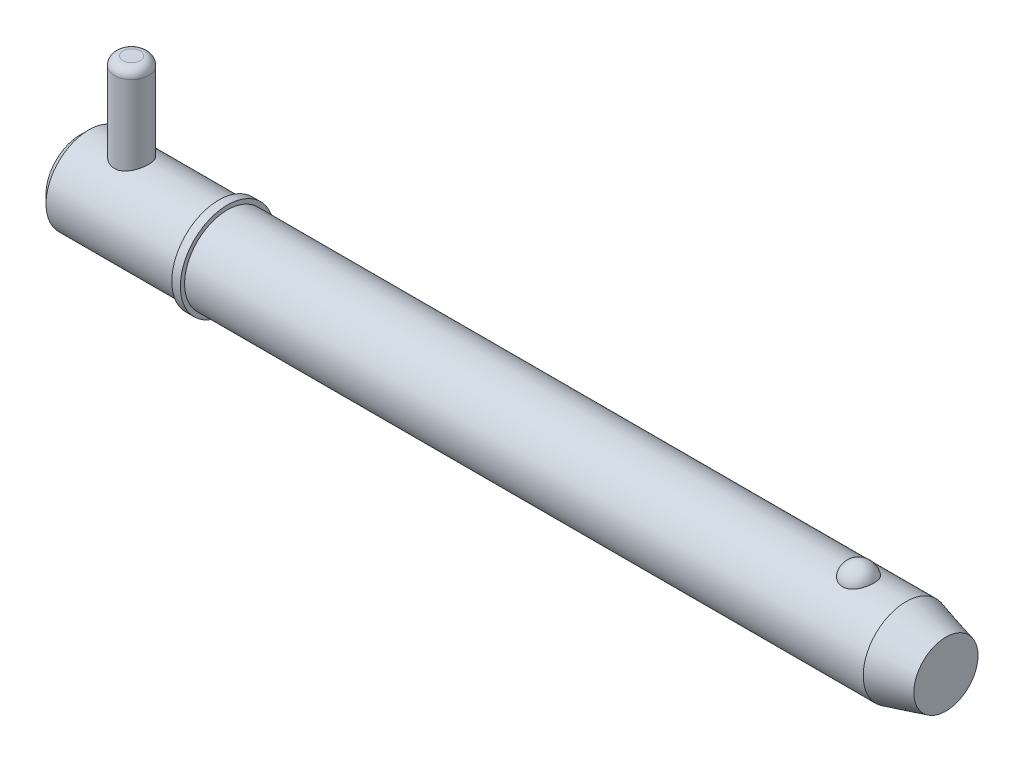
ISO-10303-21;
HEADER;
FILE_DESCRIPTION(('STEP AP214'),'2;1');
FILE_NAME('part.step','',(''),(''),'','','');
FILE_SCHEMA(('AUTOMOTIVE_DESIGN { 1 0 10303 214 1 1 1 1 }'));
ENDSEC;
DATA;
#1=APPLICATION_CONTEXT('core data for automotive mechanical design processes');
#2=APPLICATION_PROTOCOL_DEFINITION('international standard','automotive_design',2000,#1);
#3=PRODUCT_CONTEXT('',#1,'mechanical');
#4=PRODUCT('Part','Part','',(#3));
#5=PRODUCT_RELATED_PRODUCT_CATEGORY('part','',(#4));
#6=PRODUCT_DEFINITION_FORMATION('','',#4);
#7=PRODUCT_DEFINITION_CONTEXT('part definition',#1,'design');
#8=PRODUCT_DEFINITION('design','',#6,#7);
#9=PRODUCT_DEFINITION_SHAPE('','',#8);
#10=(LENGTH_UNIT() NAMED_UNIT(*) SI_UNIT(.MILLI.,.METRE.));
#11=(NAMED_UNIT(*) PLANE_ANGLE_UNIT() SI_UNIT($,.RADIAN.));
#12=(NAMED_UNIT(*) SI_UNIT($,.STERADIAN.) SOLID_ANGLE_UNIT());
#13=UNCERTAINTY_MEASURE_WITH_UNIT(LENGTH_MEASURE(1.E-05),#10,'distance_accuracy_value','');
#14=(GEOMETRIC_REPRESENTATION_CONTEXT(3) GLOBAL_UNCERTAINTY_ASSIGNED_CONTEXT((#13)) GLOBAL_UNIT_ASSIGNED_CONTEXT((#10,
#11,#12)) REPRESENTATION_CONTEXT('',''));
#15=CARTESIAN_POINT('',(0.,0.,0.));
#16=DIRECTION('',(0.,0.,1.));
#17=DIRECTION('',(1.,0.,0.));
#18=AXIS2_PLACEMENT_3D('',#15,#16,#17);
#19=CARTESIAN_POINT('',(9.525,23.81,0.));
#20=DIRECTION('',(0.,-1.,0.));
#21=DIRECTION('',(0.,0.,-1.));
#22=AXIS2_PLACEMENT_3D('',#19,#20,#21);
#23=CYLINDRICAL_SURFACE('',#22,3.175);
#24=CARTESIAN_POINT('',(9.525,-6.3525,0.));
#25=DIRECTION('',(0.,1.,0.));
#26=DIRECTION('',(0.,0.,1.));
#27=AXIS2_PLACEMENT_3D('',#24,#25,#26);
#28=CIRCLE('',#27,3.175);
#29=CARTESIAN_POINT('',(9.525,-6.3525,3.175));
#30=VERTEX_POINT('',#29);
#31=EDGE_CURVE('P0_E25',#30,#30,#28,.T.);
#32=ORIENTED_EDGE('',*,*,#31,.T.);
#33=EDGE_LOOP('',(#32));
#34=FACE_BOUND('',#33,.T.);
#35=CARTESIAN_POINT('',(9.525,22.2225,0.));
#36=DIRECTION('',(0.,1.,0.));
#37=DIRECTION('',(0.,0.,1.));
#38=AXIS2_PLACEMENT_3D('',#35,#36,#37);
#39=CIRCLE('',#38,3.175);
#40=CARTESIAN_POINT('',(9.525,22.2225,3.175));
#41=VERTEX_POINT('',#40);
#42=EDGE_CURVE('P0_E29',#41,#41,#39,.F.);
#43=ORIENTED_EDGE('',*,*,#42,.T.);
#44=EDGE_LOOP('',(#43));
#45=FACE_BOUND('',#44,.T.);
#46=ADVANCED_FACE('P0_F14',(#34,#45),#23,.T.);
#47=CARTESIAN_POINT('',(9.525,23.81,0.));
#48=DIRECTION('',(0.,1.,0.));
#49=DIRECTION('',(0.,0.,1.));
#50=AXIS2_PLACEMENT_3D('',#47,#48,#49);
#51=PLANE('',#50);
#52=CARTESIAN_POINT('',(9.525,23.81,0.));
#53=DIRECTION('',(0.,1.,0.));
#54=DIRECTION('',(0.,0.,1.));
#55=AXIS2_PLACEMENT_3D('',#52,#53,#54);
#56=CIRCLE('',#55,1.5875);
#57=CARTESIAN_POINT('',(9.525,23.81,1.5875));
#58=VERTEX_POINT('',#57);
#59=EDGE_CURVE('P0_E10',#58,#58,#56,.T.);
#60=ORIENTED_EDGE('',*,*,#59,.T.);
#61=EDGE_LOOP('',(#60));
#62=FACE_BOUND('',#61,.T.);
#63=ADVANCED_FACE('P0_F46',(#62),#51,.T.);
#64=CARTESIAN_POINT('',(9.525,-7.94,0.));
#65=DIRECTION('',(0.,1.,0.));
#66=DIRECTION('',(0.,0.,1.));
#67=AXIS2_PLACEMENT_3D('',#64,#65,#66);
#68=PLANE('',#67);
#69=CARTESIAN_POINT('',(9.525,-7.94,0.));
#70=DIRECTION('',(0.,1.,0.));
#71=DIRECTION('',(0.,0.,1.));
#72=AXIS2_PLACEMENT_3D('',#69,#70,#71);
#73=CIRCLE('',#72,1.5875);
#74=CARTESIAN_POINT('',(9.525,-7.94,1.5875));
#75=VERTEX_POINT('',#74);
#76=EDGE_CURVE('P0_E21',#75,#75,#73,.F.);
#77=ORIENTED_EDGE('',*,*,#76,.T.);
#78=EDGE_LOOP('',(#77));
#79=FACE_BOUND('',#78,.T.);
#80=ADVANCED_FACE('P0_F43',(#79),#68,.F.);
#81=CARTESIAN_POINT('',(9.525,-6.3525,0.));
#82=DIRECTION('',(0.,1.,0.));
#83=DIRECTION('',(0.,0.,1.));
#84=AXIS2_PLACEMENT_3D('',#81,#82,#83);
#85=DEGENERATE_TOROIDAL_SURFACE('',#84,1.5875,1.5875,.T.);
#86=ORIENTED_EDGE('',*,*,#76,.F.);
#87=EDGE_LOOP('',(#86));
#88=FACE_BOUND('',#87,.T.);
#89=ORIENTED_EDGE('',*,*,#31,.F.);
#90=EDGE_LOOP('',(#89));
#91=FACE_BOUND('',#90,.T.);
#92=ADVANCED_FACE('P0_F38',(#88,#91),#85,.T.);
#93=CARTESIAN_POINT('',(9.525,22.2225,0.));
#94=DIRECTION('',(0.,1.,0.));
#95=DIRECTION('',(0.,0.,1.));
#96=AXIS2_PLACEMENT_3D('',#93,#94,#95);
#97=DEGENERATE_TOROIDAL_SURFACE('',#96,1.5875,1.5875,.T.);
#98=ORIENTED_EDGE('',*,*,#42,.F.);
#99=EDGE_LOOP('',(#98));
#100=FACE_BOUND('',#99,.T.);
#101=ORIENTED_EDGE('',*,*,#59,.F.);
#102=EDGE_LOOP('',(#101));
#103=FACE_BOUND('',#102,.T.);
#104=ADVANCED_FACE('P0_F16',(#100,#103),#97,.T.);
#105=CLOSED_SHELL('',(#46,#63,#80,#92,#104));
#106=MANIFOLD_SOLID_BREP('P0_B1',#105);
#107=CARTESIAN_POINT('',(0.,0.,0.));
#108=DIRECTION('',(1.,0.,0.));
#109=DIRECTION('',(0.,0.,-1.));
#110=AXIS2_PLACEMENT_3D('',#107,#108,#109);
#111=CYLINDRICAL_SURFACE('',#110,7.94);
#112=CARTESIAN_POINT('',(153.251879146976,0.,0.));
#113=DIRECTION('',(1.,0.,0.));
#114=DIRECTION('',(0.,0.,-1.));
#115=AXIS2_PLACEMENT_3D('',#112,#113,#114);
#116=CIRCLE('',#115,7.94);
#117=CARTESIAN_POINT('',(153.251879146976,0.,-7.94));
#118=VERTEX_POINT('',#117);
#119=EDGE_CURVE('P1_E81',#118,#118,#116,.T.);
#120=ORIENTED_EDGE('',*,*,#119,.F.);
#121=EDGE_LOOP('',(#120));
#122=FACE_BOUND('',#121,.T.);
#123=CARTESIAN_POINT('',(27.31,0.,0.));
#124=DIRECTION('',(1.,0.,0.));
#125=DIRECTION('',(0.,0.,-1.));
#126=AXIS2_PLACEMENT_3D('',#123,#124,#125);
#127=CIRCLE('',#126,7.94);
#128=CARTESIAN_POINT('',(27.31,0.,-7.94));
#129=VERTEX_POINT('',#128);
#130=EDGE_CURVE('P1_E85',#129,#129,#127,.T.);
#131=ORIENTED_EDGE('',*,*,#130,.T.);
#132=EDGE_LOOP('',(#131));
#133=FACE_BOUND('',#132,.T.);
#134=CARTESIAN_POINT('',(144.444907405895,7.37767842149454,2.93486986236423));
#135=CARTESIAN_POINT('',(144.292749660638,7.3776732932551,2.93487505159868));
#136=CARTESIAN_POINT('',(144.140632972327,7.38258419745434,2.92262454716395));
#137=CARTESIAN_POINT('',(143.840928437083,7.40163229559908,2.87404196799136));
#138=CARTESIAN_POINT('',(143.693339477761,7.41576720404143,2.83771585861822));
#139=CARTESIAN_POINT('',(143.407018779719,7.45161576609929,2.74218769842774));
#140=CARTESIAN_POINT('',(143.268274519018,7.47331841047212,2.68301886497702));
#141=CARTESIAN_POINT('',(143.002882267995,7.52194082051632,2.54350967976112));
#142=CARTESIAN_POINT('',(142.876236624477,7.54886159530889,2.46316523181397));
#143=CARTESIAN_POINT('',(142.634534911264,7.60594671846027,2.28090375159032));
#144=CARTESIAN_POINT('',(142.519906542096,7.63618114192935,2.1784421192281));
#145=CARTESIAN_POINT('',(142.308878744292,7.69614046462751,1.95608495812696));
#146=CARTESIAN_POINT('',(142.212482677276,7.72586526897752,1.83618622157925));
#147=CARTESIAN_POINT('',(142.035938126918,7.78314821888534,1.57628086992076));
#148=CARTESIAN_POINT('',(141.956707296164,7.81055035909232,1.43561546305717));
#149=CARTESIAN_POINT('',(141.821797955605,7.85879631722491,1.14236334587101));
#150=CARTESIAN_POINT('',(141.766121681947,7.87963951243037,0.989775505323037));
#151=CARTESIAN_POINT('',(141.67881215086,7.91289645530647,0.674619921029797));
#152=CARTESIAN_POINT('',(141.64753090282,7.92518652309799,0.511941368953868));
#153=CARTESIAN_POINT('',(141.610975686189,7.93958930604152,0.183247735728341));
#154=CARTESIAN_POINT('',(141.605701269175,7.94170219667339,0.0172327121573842));
#155=CARTESIAN_POINT('',(141.621231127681,7.93554931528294,-0.312672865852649));
#156=CARTESIAN_POINT('',(141.641925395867,7.92732732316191,-0.476569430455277));
#157=CARTESIAN_POINT('',(141.70878655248,7.90141534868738,-0.79830524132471));
#158=CARTESIAN_POINT('',(141.754953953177,7.88372517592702,-0.956144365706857));
#159=CARTESIAN_POINT('',(141.871898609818,7.84066230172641,-1.26152073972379));
#160=CARTESIAN_POINT('',(141.942704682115,7.81528060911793,-1.40904568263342));
#161=CARTESIAN_POINT('',(142.107478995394,7.75948672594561,-1.68950598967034));
#162=CARTESIAN_POINT('',(142.201448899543,7.72907417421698,-1.82244030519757));
#163=CARTESIAN_POINT('',(142.410839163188,7.66640424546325,-2.07032792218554));
#164=CARTESIAN_POINT('',(142.526315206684,7.63414223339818,-2.18523308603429));
#165=CARTESIAN_POINT('',(142.7759006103,7.57149681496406,-2.39329737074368));
#166=CARTESIAN_POINT('',(142.910008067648,7.54111321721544,-2.48645870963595));
#167=CARTESIAN_POINT('',(143.190111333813,7.48650742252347,-2.64628132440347));
#168=CARTESIAN_POINT('',(143.335760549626,7.46215900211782,-2.71350554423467));
#169=CARTESIAN_POINT('',(143.637425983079,7.42171253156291,-2.82226614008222));
#170=CARTESIAN_POINT('',(143.793438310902,7.40561140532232,-2.86381209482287));
#171=CARTESIAN_POINT('',(144.102970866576,7.3842679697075,-2.9183907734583));
#172=CARTESIAN_POINT('',(144.256222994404,7.37852109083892,-2.93275024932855));
#173=CARTESIAN_POINT('',(144.563070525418,7.37700973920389,-2.93655208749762));
#174=CARTESIAN_POINT('',(144.716665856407,7.38124333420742,-2.92599927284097));
#175=CARTESIAN_POINT('',(145.014990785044,7.39890635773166,-2.88102897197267));
#176=CARTESIAN_POINT('',(145.159848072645,7.41205491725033,-2.84733999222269));
#177=CARTESIAN_POINT('',(145.44164329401,7.445801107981,-2.75788206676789));
#178=CARTESIAN_POINT('',(145.578580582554,7.46639934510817,-2.70211132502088));
#179=CARTESIAN_POINT('',(145.844061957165,7.51339098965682,-2.56858908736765));
#180=CARTESIAN_POINT('',(145.972354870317,7.53990200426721,-2.4903806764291));
#181=CARTESIAN_POINT('',(146.214244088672,7.59569503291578,-2.31462737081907));
#182=CARTESIAN_POINT('',(146.327837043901,7.6249776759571,-2.21707808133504));
#183=CARTESIAN_POINT('',(146.54322156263,7.68489473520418,-1.99982049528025));
#184=CARTESIAN_POINT('',(146.644148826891,7.71552419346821,-1.87925337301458));
#185=CARTESIAN_POINT('',(146.825186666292,7.77353016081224,-1.6226882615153));
#186=CARTESIAN_POINT('',(146.905293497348,7.80090608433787,-1.48668750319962));
#187=CARTESIAN_POINT('',(147.045361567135,7.85047992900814,-1.1981841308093));
#188=CARTESIAN_POINT('',(147.104587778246,7.87248183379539,-1.04529016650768));
#189=CARTESIAN_POINT('',(147.197982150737,7.90785114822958,-0.731080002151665));
#190=CARTESIAN_POINT('',(147.232149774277,7.92121837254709,-0.569763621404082));
#191=CARTESIAN_POINT('',(147.274795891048,7.93797834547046,-0.242812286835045));
#192=CARTESIAN_POINT('',(147.283204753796,7.94134405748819,-0.0771668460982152));
#193=CARTESIAN_POINT('',(147.273962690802,7.93767937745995,0.253276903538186));
#194=CARTESIAN_POINT('',(147.256312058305,7.93064910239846,0.418075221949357));
#195=CARTESIAN_POINT('',(147.195424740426,7.90695571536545,0.741525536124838));
#196=CARTESIAN_POINT('',(147.152281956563,7.8903279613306,0.900197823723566));
#197=CARTESIAN_POINT('',(147.04135358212,7.84916386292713,1.20759654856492));
#198=CARTESIAN_POINT('',(146.97356656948,7.82462706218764,1.35632241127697));
#199=CARTESIAN_POINT('',(146.814371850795,7.77006699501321,1.64032869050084));
#200=CARTESIAN_POINT('',(146.722861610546,7.74002008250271,1.7755471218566));
#201=CARTESIAN_POINT('',(146.518296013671,7.67774175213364,2.0280064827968));
#202=CARTESIAN_POINT('',(146.405241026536,7.64551037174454,2.14524772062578));
#203=CARTESIAN_POINT('',(146.160831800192,7.58265895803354,2.35778002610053));
#204=CARTESIAN_POINT('',(146.029583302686,7.5520309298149,2.45319004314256));
#205=CARTESIAN_POINT('',(145.751601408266,7.49579792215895,2.61999897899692));
#206=CARTESIAN_POINT('',(145.604867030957,7.4701932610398,2.69139637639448));
#207=CARTESIAN_POINT('',(145.292947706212,7.42622216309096,2.8105324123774));
#208=CARTESIAN_POINT('',(145.127220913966,7.40825002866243,2.85700910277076));
#209=CARTESIAN_POINT('',(144.789279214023,7.38398348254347,2.9191685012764));
#210=CARTESIAN_POINT('',(144.61706702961,7.3776842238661,2.93486399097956));
#211=CARTESIAN_POINT('',(144.444907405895,7.37767842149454,2.93486986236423));
#212=B_SPLINE_CURVE_WITH_KNOTS('',3,(#134,#135,#136,#137,#138,#139,#140,#141,#142,#143,#144,
#145,#146,#147,#148,#149,#150,#151,#152,#153,#154,#155,#156,#157,#158,#159,#160,#161,#162,#163,
#164,#165,#166,#167,#168,#169,#170,#171,#172,#173,#174,#175,#176,#177,#178,#179,#180,#181,#182,
#183,#184,#185,#186,#187,#188,#189,#190,#191,#192,#193,#194,#195,#196,#197,#198,#199,#200,#201,
#202,#203,#204,#205,#206,#207,#208,#209,#210,#211),.UNSPECIFIED.,.T.,.F.,(4,2,2,2,2,2,2,2,2,2,2,
2,2,2,2,2,2,2,2,2,2,2,2,2,2,2,2,2,2,2,2,2,2,2,2,2,2,2,4),(0.,0.455841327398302,
0.911569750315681,1.36663794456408,1.82179423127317,2.2897898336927,2.75787163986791,
3.24685368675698,3.73588214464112,4.23184282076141,4.72779494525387,5.22165321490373,
5.71552141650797,6.20996917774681,6.7044524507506,7.20023431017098,7.69596557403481,
8.18023418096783,8.66432203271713,9.12410697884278,9.58380291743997,10.0296503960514,
10.4755341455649,10.9312349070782,11.3870393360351,11.8654416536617,12.3439299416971,
12.8378875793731,13.3318558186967,13.8271581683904,14.3224549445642,14.8159385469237,
15.3094506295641,15.8051323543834,16.3008055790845,16.7937101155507,17.2866458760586,
17.8026240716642,18.3183879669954),.UNSPECIFIED.);
#213=CARTESIAN_POINT('',(144.444907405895,7.37767842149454,2.93486986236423));
#214=VERTEX_POINT('',#213);
#215=EDGE_CURVE('P1_E35',#214,#214,#212,.T.);
#216=ORIENTED_EDGE('',*,*,#215,.T.);
#217=EDGE_LOOP('',(#216));
#218=FACE_BOUND('',#217,.T.);
#219=ADVANCED_FACE('P1_F13',(#122,#133,#218),#111,.T.);
#220=CARTESIAN_POINT('',(0.,0.,0.));
#221=DIRECTION('',(-1.,0.,0.));
#222=DIRECTION('',(0.,0.,1.));
#223=AXIS2_PLACEMENT_3D('',#220,#221,#222);
#224=PLANE('',#223);
#225=CARTESIAN_POINT('',(0.,0.,0.));
#226=DIRECTION('',(1.,0.,0.));
#227=DIRECTION('',(0.,0.,-1.));
#228=AXIS2_PLACEMENT_3D('',#225,#226,#227);
#229=CIRCLE('',#228,6.352);
#230=CARTESIAN_POINT('',(0.,0.,-6.352));
#231=VERTEX_POINT('',#230);
#232=EDGE_CURVE('P1_E9',#231,#231,#229,.T.);
#233=ORIENTED_EDGE('',*,*,#232,.F.);
#234=EDGE_LOOP('',(#233));
#235=FACE_BOUND('',#234,.T.);
#236=ADVANCED_FACE('P1_F15',(#235),#224,.T.);
#237=CARTESIAN_POINT('',(1.58799999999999,0.,0.));
#238=DIRECTION('',(1.,0.,0.));
#239=DIRECTION('',(0.,0.,-1.));
#240=AXIS2_PLACEMENT_3D('',#237,#238,#239);
#241=CONICAL_SURFACE('',#240,7.94,0.78539816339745);
#242=ORIENTED_EDGE('',*,*,#232,.T.);
#243=EDGE_LOOP('',(#242));
#244=FACE_BOUND('',#243,.T.);
#245=CARTESIAN_POINT('',(1.58799999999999,0.,0.));
#246=DIRECTION('',(1.,0.,0.));
#247=DIRECTION('',(0.,0.,-1.));
#248=AXIS2_PLACEMENT_3D('',#245,#246,#247);
#249=CIRCLE('',#248,7.94);
#250=CARTESIAN_POINT('',(1.58799999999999,0.,-7.94));
#251=VERTEX_POINT('',#250);
#252=EDGE_CURVE('P1_E26',#251,#251,#249,.T.);
#253=ORIENTED_EDGE('',*,*,#252,.F.);
#254=EDGE_LOOP('',(#253));
#255=FACE_BOUND('',#254,.T.);
#256=ADVANCED_FACE('P1_F77',(#244,#255),#241,.T.);
#257=CARTESIAN_POINT('',(0.,0.,0.));
#258=DIRECTION('',(1.,0.,0.));
#259=DIRECTION('',(0.,0.,-1.));
#260=AXIS2_PLACEMENT_3D('',#257,#258,#259);
#261=CYLINDRICAL_SURFACE('',#260,7.94);
#262=CARTESIAN_POINT('',(9.525,-7.27756655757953,3.175));
#263=CARTESIAN_POINT('',(9.43992346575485,-7.27756715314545,3.17499935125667));
#264=CARTESIAN_POINT('',(9.35481882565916,-7.27906496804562,3.1715736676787));
#265=CARTESIAN_POINT('',(9.18524505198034,-7.28499816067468,3.15791803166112));
#266=CARTESIAN_POINT('',(9.100776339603,-7.28943533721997,3.14768391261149));
#267=CARTESIAN_POINT('',(8.84895715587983,-7.30698881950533,3.10684226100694));
#268=CARTESIAN_POINT('',(8.6834173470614,-7.32434654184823,3.06609574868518));
#269=CARTESIAN_POINT('',(8.36278910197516,-7.36806950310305,2.95945910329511));
#270=CARTESIAN_POINT('',(8.20766386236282,-7.39440078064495,2.89366366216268));
#271=CARTESIAN_POINT('',(7.91065319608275,-7.45304562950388,2.73907413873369));
#272=CARTESIAN_POINT('',(7.76876488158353,-7.48535789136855,2.65028508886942));
#273=CARTESIAN_POINT('',(7.49411086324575,-7.55439482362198,2.44679888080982));
#274=CARTESIAN_POINT('',(7.36219910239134,-7.59126138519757,2.33099745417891));
#275=CARTESIAN_POINT('',(7.11904234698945,-7.66408045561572,2.07909838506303));
#276=CARTESIAN_POINT('',(7.00780457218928,-7.70003264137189,1.94299368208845));
#277=CARTESIAN_POINT('',(6.80492173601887,-7.76867514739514,1.64775981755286));
#278=CARTESIAN_POINT('',(6.71422139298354,-7.80118112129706,1.48793473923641));
#279=CARTESIAN_POINT('',(6.56135788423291,-7.85754918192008,1.15376269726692));
#280=CARTESIAN_POINT('',(6.49918311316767,-7.88141478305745,0.979421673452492));
#281=CARTESIAN_POINT('',(6.40818142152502,-7.91680873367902,0.630115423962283));
#282=CARTESIAN_POINT('',(6.3778864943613,-7.9288781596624,0.455588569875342));
#283=CARTESIAN_POINT('',(6.34677743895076,-7.94127547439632,0.103539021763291));
#284=CARTESIAN_POINT('',(6.34595232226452,-7.94160773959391,-0.0739825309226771));
#285=CARTESIAN_POINT('',(6.37300128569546,-7.93082261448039,-0.416371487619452));
#286=CARTESIAN_POINT('',(6.39926693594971,-7.92034690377,-0.581389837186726));
#287=CARTESIAN_POINT('',(6.47701615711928,-7.88998770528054,-0.904449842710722));
#288=CARTESIAN_POINT('',(6.52850157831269,-7.87010352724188,-1.06249098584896));
#289=CARTESIAN_POINT('',(6.65586120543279,-7.82249343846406,-1.36995769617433));
#290=CARTESIAN_POINT('',(6.73209124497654,-7.79465387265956,-1.51921754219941));
#291=CARTESIAN_POINT('',(6.90644286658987,-7.73389606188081,-1.80321183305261));
#292=CARTESIAN_POINT('',(7.00457194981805,-7.70097607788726,-1.93794127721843));
#293=CARTESIAN_POINT('',(7.22744086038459,-7.63084889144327,-2.19843606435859));
#294=CARTESIAN_POINT('',(7.35350432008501,-7.59350211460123,-2.3230330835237));
#295=CARTESIAN_POINT('',(7.62488266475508,-7.52039654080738,-2.54979642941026));
#296=CARTESIAN_POINT('',(7.77020381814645,-7.48463826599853,-2.65195542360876));
#297=CARTESIAN_POINT('',(8.08119298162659,-7.41780943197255,-2.83361305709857));
#298=CARTESIAN_POINT('',(8.24731937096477,-7.38689959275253,-2.91239105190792));
#299=CARTESIAN_POINT('',(8.59204539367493,-7.33515216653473,-3.04038913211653));
#300=CARTESIAN_POINT('',(8.77063684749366,-7.31430804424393,-3.08962840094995));
#301=CARTESIAN_POINT('',(9.12356982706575,-7.28663831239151,-3.15431018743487));
#302=CARTESIAN_POINT('',(9.29750494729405,-7.2790344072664,-3.17163284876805));
#303=CARTESIAN_POINT('',(9.64592502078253,-7.27648884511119,-3.17747282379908));
#304=CARTESIAN_POINT('',(9.82040979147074,-7.28154335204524,-3.16599886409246));
#305=CARTESIAN_POINT('',(10.1545374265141,-7.30294638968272,-3.11628310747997));
#306=CARTESIAN_POINT('',(10.3144598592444,-7.31863587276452,-3.0796016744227));
#307=CARTESIAN_POINT('',(10.625774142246,-7.35872371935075,-2.98253618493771));
#308=CARTESIAN_POINT('',(10.7771640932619,-7.38312401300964,-2.92214687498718));
#309=CARTESIAN_POINT('',(11.0739599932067,-7.4390944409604,-2.77664664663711));
#310=CARTESIAN_POINT('',(11.2188745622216,-7.47091513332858,-2.69063278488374));
#311=CARTESIAN_POINT('',(11.4928722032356,-7.53775867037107,-2.49724834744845));
#312=CARTESIAN_POINT('',(11.6219487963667,-7.57278281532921,-2.38986907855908));
#313=CARTESIAN_POINT('',(11.8705091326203,-7.64520845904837,-2.1474449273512));
#314=CARTESIAN_POINT('',(11.9885816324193,-7.68259462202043,-2.01094304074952));
#315=CARTESIAN_POINT('',(12.2003631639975,-7.75309951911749,-1.71917041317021));
#316=CARTESIAN_POINT('',(12.2940712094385,-7.78621808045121,-1.56389891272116));
#317=CARTESIAN_POINT('',(12.4541161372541,-7.84456050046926,-1.23845027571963));
#318=CARTESIAN_POINT('',(12.5204600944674,-7.86978639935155,-1.06827700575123));
#319=CARTESIAN_POINT('',(12.6231407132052,-7.90943635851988,-0.717928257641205));
#320=CARTESIAN_POINT('',(12.6594936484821,-7.92386627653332,-0.537758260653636));
#321=CARTESIAN_POINT('',(12.6992281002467,-7.93967263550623,-0.185201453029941));
#322=CARTESIAN_POINT('',(12.7046050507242,-7.94183891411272,-0.0130732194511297));
#323=CARTESIAN_POINT('',(12.6875036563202,-7.9350072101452,0.329549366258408));
#324=CARTESIAN_POINT('',(12.6650295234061,-7.92601091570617,0.500043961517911));
#325=CARTESIAN_POINT('',(12.5942896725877,-7.89825976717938,0.829196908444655));
#326=CARTESIAN_POINT('',(12.5468364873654,-7.87981280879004,0.988057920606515));
#327=CARTESIAN_POINT('',(12.4283390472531,-7.83513565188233,1.29553461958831));
#328=CARTESIAN_POINT('',(12.3572904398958,-7.8089040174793,1.44414841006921));
#329=CARTESIAN_POINT('',(12.1900822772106,-7.7497911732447,1.73412879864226));
#330=CARTESIAN_POINT('',(12.0929519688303,-7.71666737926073,1.87488510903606));
#331=CARTESIAN_POINT('',(11.8777894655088,-7.64775894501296,2.13869231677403));
#332=CARTESIAN_POINT('',(11.7597486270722,-7.61197320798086,2.26173585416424));
#333=CARTESIAN_POINT('',(11.4974896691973,-7.53902341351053,2.49449755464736));
#334=CARTESIAN_POINT('',(11.3521039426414,-7.50191102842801,2.60292060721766));
#335=CARTESIAN_POINT('',(11.0440201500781,-7.43289551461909,2.79392602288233));
#336=CARTESIAN_POINT('',(10.8813200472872,-7.40099299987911,2.87650534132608));
#337=CARTESIAN_POINT('',(10.558064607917,-7.3489506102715,3.00682739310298));
#338=CARTESIAN_POINT('',(10.398627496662,-7.32801197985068,3.05703164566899));
#339=CARTESIAN_POINT('',(10.0731242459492,-7.29639491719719,3.13175843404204));
#340=CARTESIAN_POINT('',(9.90707793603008,-7.28568789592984,3.15635254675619));
#341=CARTESIAN_POINT('',(9.70441566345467,-7.27968826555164,3.17013149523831));
#342=CARTESIAN_POINT('',(9.66856669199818,-7.27889378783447,3.17195593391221));
#343=CARTESIAN_POINT('',(9.59681348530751,-7.27783278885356,3.17439036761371));
#344=CARTESIAN_POINT('',(9.56090924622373,-7.27756630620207,3.17500027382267));
#345=CARTESIAN_POINT('',(9.525,-7.27756655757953,3.175));
#346=B_SPLINE_CURVE_WITH_KNOTS('',3,(#262,#263,#264,#265,#266,#267,#268,#269,#270,#271,#272,
#273,#274,#275,#276,#277,#278,#279,#280,#281,#282,#283,#284,#285,#286,#287,#288,#289,#290,#291,
#292,#293,#294,#295,#296,#297,#298,#299,#300,#301,#302,#303,#304,#305,#306,#307,#308,#309,#310,
#311,#312,#313,#314,#315,#316,#317,#318,#319,#320,#321,#322,#323,#324,#325,#326,#327,#328,#329,
#330,#331,#332,#333,#334,#335,#336,#337,#338,#339,#340,#341,#342,#343,#344,#345),.UNSPECIFIED.,
.T.,.F.,(4,2,2,2,2,2,2,2,2,2,2,2,2,2,2,2,2,2,2,2,2,2,2,2,2,2,2,2,2,2,2,2,2,2,2,2,2,2,2,2,2,4),
(0.,0.255187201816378,0.510530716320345,1.0218798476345,1.53131482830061,2.04063840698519,
2.57635929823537,3.11226692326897,3.66929090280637,4.22608806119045,4.75594400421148,
5.28560237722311,5.78552836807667,6.28549104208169,6.79298787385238,7.30065880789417,
7.8416422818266,8.38280228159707,8.93923025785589,9.49529647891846,10.0174074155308,
10.5393601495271,11.0316114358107,11.5239718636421,12.0362920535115,12.5488211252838,
13.0991799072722,13.6495609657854,14.1997996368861,14.7497395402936,15.2638187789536,
15.7778202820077,16.2760504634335,16.7743726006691,17.294711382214,17.8152657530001,
18.3680208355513,18.9208410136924,19.4240423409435,19.9258334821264,20.0335354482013,
20.1412452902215),.UNSPECIFIED.);
#347=CARTESIAN_POINT('',(9.525,-7.27756655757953,3.175));
#348=VERTEX_POINT('',#347);
#349=EDGE_CURVE('P1_E17',#348,#348,#346,.T.);
#350=ORIENTED_EDGE('',*,*,#349,.F.);
#351=EDGE_LOOP('',(#350));
#352=FACE_BOUND('',#351,.T.);
#353=CARTESIAN_POINT('',(9.525,7.27756655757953,3.175));
#354=CARTESIAN_POINT('',(9.61007653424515,7.27756715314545,3.17499935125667));
#355=CARTESIAN_POINT('',(9.69518117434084,7.27906496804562,3.1715736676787));
#356=CARTESIAN_POINT('',(9.86475494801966,7.28499816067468,3.15791803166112));
#357=CARTESIAN_POINT('',(9.949223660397,7.28943533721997,3.14768391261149));
#358=CARTESIAN_POINT('',(10.2010428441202,7.30698881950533,3.10684226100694));
#359=CARTESIAN_POINT('',(10.3665826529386,7.32434654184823,3.06609574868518));
#360=CARTESIAN_POINT('',(10.6872108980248,7.36806950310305,2.95945910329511));
#361=CARTESIAN_POINT('',(10.8423361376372,7.39440078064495,2.89366366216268));
#362=CARTESIAN_POINT('',(11.1393468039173,7.45304562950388,2.73907413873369));
#363=CARTESIAN_POINT('',(11.2812351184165,7.48535789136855,2.65028508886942));
#364=CARTESIAN_POINT('',(11.5558891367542,7.55439482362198,2.44679888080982));
#365=CARTESIAN_POINT('',(11.6878008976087,7.59126138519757,2.33099745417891));
#366=CARTESIAN_POINT('',(11.9309576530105,7.66408045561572,2.07909838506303));
#367=CARTESIAN_POINT('',(12.0421954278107,7.70003264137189,1.94299368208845));
#368=CARTESIAN_POINT('',(12.2450782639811,7.76867514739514,1.64775981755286));
#369=CARTESIAN_POINT('',(12.3357786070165,7.80118112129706,1.48793473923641));
#370=CARTESIAN_POINT('',(12.4886421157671,7.85754918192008,1.15376269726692));
#371=CARTESIAN_POINT('',(12.5508168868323,7.88141478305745,0.979421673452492));
#372=CARTESIAN_POINT('',(12.641818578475,7.91680873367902,0.630115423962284));
#373=CARTESIAN_POINT('',(12.6721135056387,7.9288781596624,0.455588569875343));
#374=CARTESIAN_POINT('',(12.7032225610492,7.94127547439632,0.103539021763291));
#375=CARTESIAN_POINT('',(12.7040476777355,7.94160773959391,-0.0739825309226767));
#376=CARTESIAN_POINT('',(12.6769987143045,7.93082261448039,-0.416371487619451));
#377=CARTESIAN_POINT('',(12.6507330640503,7.92034690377,-0.581389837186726));
#378=CARTESIAN_POINT('',(12.5729838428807,7.88998770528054,-0.904449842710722));
#379=CARTESIAN_POINT('',(12.5214984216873,7.87010352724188,-1.06249098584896));
#380=CARTESIAN_POINT('',(12.3941387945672,7.82249343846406,-1.36995769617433));
#381=CARTESIAN_POINT('',(12.3179087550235,7.79465387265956,-1.51921754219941));
#382=CARTESIAN_POINT('',(12.1435571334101,7.73389606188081,-1.80321183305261));
#383=CARTESIAN_POINT('',(12.0454280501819,7.70097607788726,-1.93794127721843));
#384=CARTESIAN_POINT('',(11.8225591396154,7.63084889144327,-2.19843606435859));
#385=CARTESIAN_POINT('',(11.696495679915,7.59350211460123,-2.3230330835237));
#386=CARTESIAN_POINT('',(11.4251173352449,7.52039654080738,-2.54979642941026));
#387=CARTESIAN_POINT('',(11.2797961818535,7.48463826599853,-2.65195542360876));
#388=CARTESIAN_POINT('',(10.9688070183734,7.41780943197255,-2.83361305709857));
#389=CARTESIAN_POINT('',(10.8026806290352,7.38689959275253,-2.91239105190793));
#390=CARTESIAN_POINT('',(10.4579546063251,7.33515216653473,-3.04038913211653));
#391=CARTESIAN_POINT('',(10.2793631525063,7.31430804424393,-3.08962840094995));
#392=CARTESIAN_POINT('',(9.92643017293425,7.28663831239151,-3.15431018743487));
#393=CARTESIAN_POINT('',(9.75249505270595,7.2790344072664,-3.17163284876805));
#394=CARTESIAN_POINT('',(9.40407497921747,7.2764888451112,-3.17747282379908));
#395=CARTESIAN_POINT('',(9.22959020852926,7.28154335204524,-3.16599886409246));
#396=CARTESIAN_POINT('',(8.89546257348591,7.30294638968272,-3.11628310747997));
#397=CARTESIAN_POINT('',(8.73554014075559,7.31863587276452,-3.0796016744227));
#398=CARTESIAN_POINT('',(8.42422585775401,7.35872371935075,-2.98253618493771));
#399=CARTESIAN_POINT('',(8.27283590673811,7.38312401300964,-2.92214687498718));
#400=CARTESIAN_POINT('',(7.97604000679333,7.4390944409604,-2.77664664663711));
#401=CARTESIAN_POINT('',(7.83112543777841,7.47091513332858,-2.69063278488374));
#402=CARTESIAN_POINT('',(7.55712779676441,7.53775867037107,-2.49724834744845));
#403=CARTESIAN_POINT('',(7.42805120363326,7.57278281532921,-2.38986907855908));
#404=CARTESIAN_POINT('',(7.17949086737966,7.64520845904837,-2.1474449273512));
#405=CARTESIAN_POINT('',(7.06141836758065,7.68259462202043,-2.01094304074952));
#406=CARTESIAN_POINT('',(6.8496368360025,7.75309951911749,-1.71917041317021));
#407=CARTESIAN_POINT('',(6.75592879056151,7.78621808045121,-1.56389891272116));
#408=CARTESIAN_POINT('',(6.59588386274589,7.84456050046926,-1.23845027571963));
#409=CARTESIAN_POINT('',(6.52953990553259,7.86978639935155,-1.06827700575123));
#410=CARTESIAN_POINT('',(6.42685928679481,7.90943635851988,-0.717928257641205));
#411=CARTESIAN_POINT('',(6.39050635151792,7.92386627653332,-0.537758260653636));
#412=CARTESIAN_POINT('',(6.35077189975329,7.93967263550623,-0.18520145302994));
#413=CARTESIAN_POINT('',(6.34539494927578,7.94183891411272,-0.0130732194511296));
#414=CARTESIAN_POINT('',(6.36249634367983,7.9350072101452,0.329549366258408));
#415=CARTESIAN_POINT('',(6.38497047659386,7.92601091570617,0.500043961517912));
#416=CARTESIAN_POINT('',(6.45571032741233,7.89825976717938,0.829196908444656));
#417=CARTESIAN_POINT('',(6.50316351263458,7.87981280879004,0.988057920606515));
#418=CARTESIAN_POINT('',(6.62166095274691,7.83513565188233,1.29553461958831));
#419=CARTESIAN_POINT('',(6.69270956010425,7.8089040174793,1.44414841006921));
#420=CARTESIAN_POINT('',(6.85991772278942,7.7497911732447,1.73412879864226));
#421=CARTESIAN_POINT('',(6.95704803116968,7.71666737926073,1.87488510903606));
#422=CARTESIAN_POINT('',(7.17221053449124,7.64775894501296,2.13869231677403));
#423=CARTESIAN_POINT('',(7.29025137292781,7.61197320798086,2.26173585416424));
#424=CARTESIAN_POINT('',(7.55251033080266,7.53902341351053,2.49449755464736));
#425=CARTESIAN_POINT('',(7.69789605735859,7.50191102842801,2.60292060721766));
#426=CARTESIAN_POINT('',(8.00597984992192,7.43289551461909,2.79392602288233));
#427=CARTESIAN_POINT('',(8.16867995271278,7.40099299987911,2.87650534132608));
#428=CARTESIAN_POINT('',(8.49193539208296,7.3489506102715,3.00682739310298));
#429=CARTESIAN_POINT('',(8.65137250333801,7.32801197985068,3.05703164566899));
#430=CARTESIAN_POINT('',(8.97687575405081,7.29639491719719,3.13175843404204));
#431=CARTESIAN_POINT('',(9.14292206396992,7.28568789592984,3.15635254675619));
#432=CARTESIAN_POINT('',(9.34558433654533,7.27968826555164,3.17013149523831));
#433=CARTESIAN_POINT('',(9.38143330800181,7.27889378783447,3.17195593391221));
#434=CARTESIAN_POINT('',(9.45318651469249,7.27783278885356,3.17439036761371));
#435=CARTESIAN_POINT('',(9.48909075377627,7.27756630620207,3.17500027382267));
#436=CARTESIAN_POINT('',(9.525,7.27756655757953,3.175));
#437=B_SPLINE_CURVE_WITH_KNOTS('',3,(#353,#354,#355,#356,#357,#358,#359,#360,#361,#362,#363,
#364,#365,#366,#367,#368,#369,#370,#371,#372,#373,#374,#375,#376,#377,#378,#379,#380,#381,#382,
#383,#384,#385,#386,#387,#388,#389,#390,#391,#392,#393,#394,#395,#396,#397,#398,#399,#400,#401,
#402,#403,#404,#405,#406,#407,#408,#409,#410,#411,#412,#413,#414,#415,#416,#417,#418,#419,#420,
#421,#422,#423,#424,#425,#426,#427,#428,#429,#430,#431,#432,#433,#434,#435,#436),.UNSPECIFIED.,
.T.,.F.,(4,2,2,2,2,2,2,2,2,2,2,2,2,2,2,2,2,2,2,2,2,2,2,2,2,2,2,2,2,2,2,2,2,2,2,2,2,2,2,2,2,4),
(0.,0.255187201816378,0.510530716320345,1.0218798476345,1.53131482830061,2.04063840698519,
2.57635929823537,3.11226692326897,3.66929090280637,4.22608806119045,4.75594400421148,
5.2856023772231,5.78552836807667,6.28549104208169,6.79298787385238,7.30065880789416,
7.8416422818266,8.38280228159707,8.9392302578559,9.49529647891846,10.0174074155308,
10.5393601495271,11.0316114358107,11.5239718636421,12.0362920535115,12.5488211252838,
13.0991799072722,13.6495609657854,14.1997996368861,14.7497395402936,15.2638187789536,
15.7778202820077,16.2760504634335,16.7743726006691,17.294711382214,17.8152657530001,
18.3680208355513,18.9208410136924,19.4240423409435,19.9258334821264,20.0335354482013,
20.1412452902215),.UNSPECIFIED.);
#438=CARTESIAN_POINT('',(9.525,7.27756655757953,3.175));
#439=VERTEX_POINT('',#438);
#440=EDGE_CURVE('P1_E43',#439,#439,#437,.T.);
#441=ORIENTED_EDGE('',*,*,#440,.F.);
#442=EDGE_LOOP('',(#441));
#443=FACE_BOUND('',#442,.T.);
#444=ORIENTED_EDGE('',*,*,#252,.T.);
#445=EDGE_LOOP('',(#444));
#446=FACE_BOUND('',#445,.T.);
#447=CARTESIAN_POINT('',(25.722,0.,0.));
#448=DIRECTION('',(1.,0.,0.));
#449=DIRECTION('',(0.,0.,-1.));
#450=AXIS2_PLACEMENT_3D('',#447,#448,#449);
#451=CIRCLE('',#450,7.94);
#452=CARTESIAN_POINT('',(25.722,0.,-7.94));
#453=VERTEX_POINT('',#452);
#454=EDGE_CURVE('P1_E31',#453,#453,#451,.T.);
#455=ORIENTED_EDGE('',*,*,#454,.F.);
#456=EDGE_LOOP('',(#455));
#457=FACE_BOUND('',#456,.T.);
#458=ADVANCED_FACE('P1_F103',(#352,#443,#446,#457),#261,.T.);
#459=CARTESIAN_POINT('',(25.722,7.94,0.));
#460=DIRECTION('',(-1.,0.,0.));
#461=DIRECTION('',(0.,0.,1.));
#462=AXIS2_PLACEMENT_3D('',#459,#460,#461);
#463=PLANE('',#462);
#464=ORIENTED_EDGE('',*,*,#454,.T.);
#465=EDGE_LOOP('',(#464));
#466=FACE_BOUND('',#465,.T.);
#467=CARTESIAN_POINT('',(25.722,0.,0.));
#468=DIRECTION('',(1.,0.,0.));
#469=DIRECTION('',(0.,0.,-1.));
#470=AXIS2_PLACEMENT_3D('',#467,#468,#469);
#471=CIRCLE('',#470,8.734);
#472=CARTESIAN_POINT('',(25.722,0.,-8.734));
#473=VERTEX_POINT('',#472);
#474=EDGE_CURVE('P1_E91',#473,#473,#471,.T.);
#475=ORIENTED_EDGE('',*,*,#474,.F.);
#476=EDGE_LOOP('',(#475));
#477=FACE_BOUND('',#476,.T.);
#478=ADVANCED_FACE('P1_F100',(#466,#477),#463,.T.);
#479=CARTESIAN_POINT('',(0.,0.,0.));
#480=DIRECTION('',(1.,0.,0.));
#481=DIRECTION('',(0.,0.,-1.));
#482=AXIS2_PLACEMENT_3D('',#479,#480,#481);
#483=CYLINDRICAL_SURFACE('',#482,8.734);
#484=ORIENTED_EDGE('',*,*,#474,.T.);
#485=EDGE_LOOP('',(#484));
#486=FACE_BOUND('',#485,.T.);
#487=CARTESIAN_POINT('',(27.31,0.,0.));
#488=DIRECTION('',(1.,0.,0.));
#489=DIRECTION('',(0.,0.,-1.));
#490=AXIS2_PLACEMENT_3D('',#487,#488,#489);
#491=CIRCLE('',#490,8.734);
#492=CARTESIAN_POINT('',(27.31,0.,-8.734));
#493=VERTEX_POINT('',#492);
#494=EDGE_CURVE('P1_E88',#493,#493,#491,.T.);
#495=ORIENTED_EDGE('',*,*,#494,.F.);
#496=EDGE_LOOP('',(#495));
#497=FACE_BOUND('',#496,.T.);
#498=ADVANCED_FACE('P1_F68',(#486,#497),#483,.T.);
#499=CARTESIAN_POINT('',(27.31,8.734,0.));
#500=DIRECTION('',(1.,0.,0.));
#501=DIRECTION('',(0.,0.,-1.));
#502=AXIS2_PLACEMENT_3D('',#499,#500,#501);
#503=PLANE('',#502);
#504=ORIENTED_EDGE('',*,*,#494,.T.);
#505=EDGE_LOOP('',(#504));
#506=FACE_BOUND('',#505,.T.);
#507=ORIENTED_EDGE('',*,*,#130,.F.);
#508=EDGE_LOOP('',(#507));
#509=FACE_BOUND('',#508,.T.);
#510=ADVANCED_FACE('P1_F62',(#506,#509),#503,.T.);
#511=CARTESIAN_POINT('',(160.66,0.,0.));
#512=DIRECTION('',(-1.,0.,0.));
#513=DIRECTION('',(0.,0.,1.));
#514=AXIS2_PLACEMENT_3D('',#511,#512,#513);
#515=CONICAL_SURFACE('',#514,5.95500000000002,0.26179938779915);
#516=ORIENTED_EDGE('',*,*,#119,.T.);
#517=EDGE_LOOP('',(#516));
#518=FACE_BOUND('',#517,.T.);
#519=CARTESIAN_POINT('',(160.66,0.,0.));
#520=DIRECTION('',(1.,0.,0.));
#521=DIRECTION('',(0.,0.,-1.));
#522=AXIS2_PLACEMENT_3D('',#519,#520,#521);
#523=CIRCLE('',#522,5.95500000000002);
#524=CARTESIAN_POINT('',(160.66,0.,-5.95500000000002));
#525=VERTEX_POINT('',#524);
#526=EDGE_CURVE('P1_E42',#525,#525,#523,.T.);
#527=ORIENTED_EDGE('',*,*,#526,.F.);
#528=EDGE_LOOP('',(#527));
#529=FACE_BOUND('',#528,.T.);
#530=ADVANCED_FACE('P1_F59',(#518,#529),#515,.T.);
#531=CARTESIAN_POINT('',(160.66,5.95500000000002,0.));
#532=DIRECTION('',(1.,0.,0.));
#533=DIRECTION('',(0.,0.,-1.));
#534=AXIS2_PLACEMENT_3D('',#531,#532,#533);
#535=PLANE('',#534);
#536=ORIENTED_EDGE('',*,*,#526,.T.);
#537=EDGE_LOOP('',(#536));
#538=FACE_BOUND('',#537,.T.);
#539=ADVANCED_FACE('P1_F55',(#538),#535,.T.);
#540=CARTESIAN_POINT('',(144.444907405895,7.146,0.));
#541=DIRECTION('',(-1.,0.,0.));
#542=DIRECTION('',(0.,1.,0.));
#543=AXIS2_PLACEMENT_3D('',#540,#541,#542);
#544=SPHERICAL_SURFACE('',#543,2.944);
#545=ORIENTED_EDGE('',*,*,#215,.F.);
#546=EDGE_LOOP('',(#545));
#547=FACE_BOUND('',#546,.T.);
#548=ADVANCED_FACE('P1_F50',(#547),#544,.T.);
#549=CARTESIAN_POINT('',(9.525,-8.734,0.));
#550=DIRECTION('',(0.,1.,0.));
#551=DIRECTION('',(0.,0.,1.));
#552=AXIS2_PLACEMENT_3D('',#549,#550,#551);
#553=CYLINDRICAL_SURFACE('',#552,3.175);
#554=ORIENTED_EDGE('',*,*,#349,.T.);
#555=EDGE_LOOP('',(#554));
#556=FACE_BOUND('',#555,.T.);
#557=ORIENTED_EDGE('',*,*,#440,.T.);
#558=EDGE_LOOP('',(#557));
#559=FACE_BOUND('',#558,.T.);
#560=ADVANCED_FACE('P1_F54',(#556,#559),#553,.F.);
#561=CLOSED_SHELL('',(#219,#236,#256,#458,#478,#498,#510,#530,#539,#548,#560));
#562=MANIFOLD_SOLID_BREP('P1_B1',#561);
#563=ADVANCED_BREP_SHAPE_REPRESENTATION('',(#18,#106,#562),#14);
#564=SHAPE_DEFINITION_REPRESENTATION(#9,#563);
ENDSEC;
END-ISO-10303-21;
